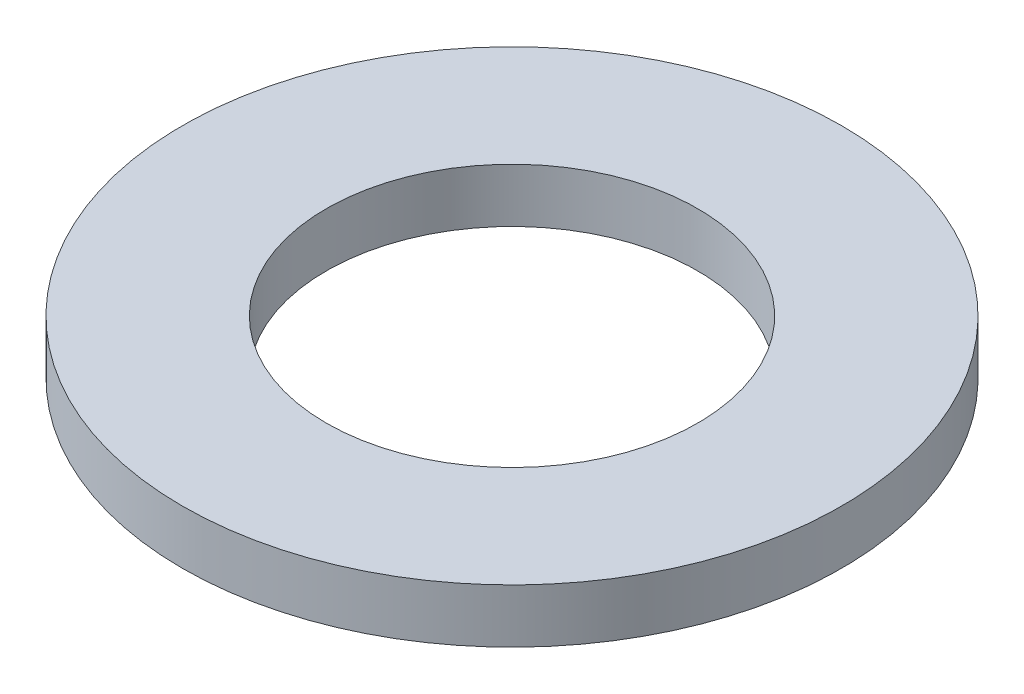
from build123d import *

# Parameters (mm, degrees)
SKETCH1_R      = 55
SKETCH1_R_2    = 31
EXTRUDE1_DEPTH = 9


with BuildPart() as part:
    # Sketch1 → Extrude1 (new body)
    with BuildSketch(Plane(origin=(0, 0, 0), x_dir=(1, 0, 0), z_dir=(0, 1, 0))):
        with Locations(Location((0, 0, 0), (0, 0, 270))):
            Circle(SKETCH1_R)
        with Locations(Location((0, 0, 0), (0, 0, 270))):
            Circle(SKETCH1_R_2, mode=Mode.SUBTRACT)
    extrude(amount=EXTRUDE1_DEPTH)


solid = part.part
